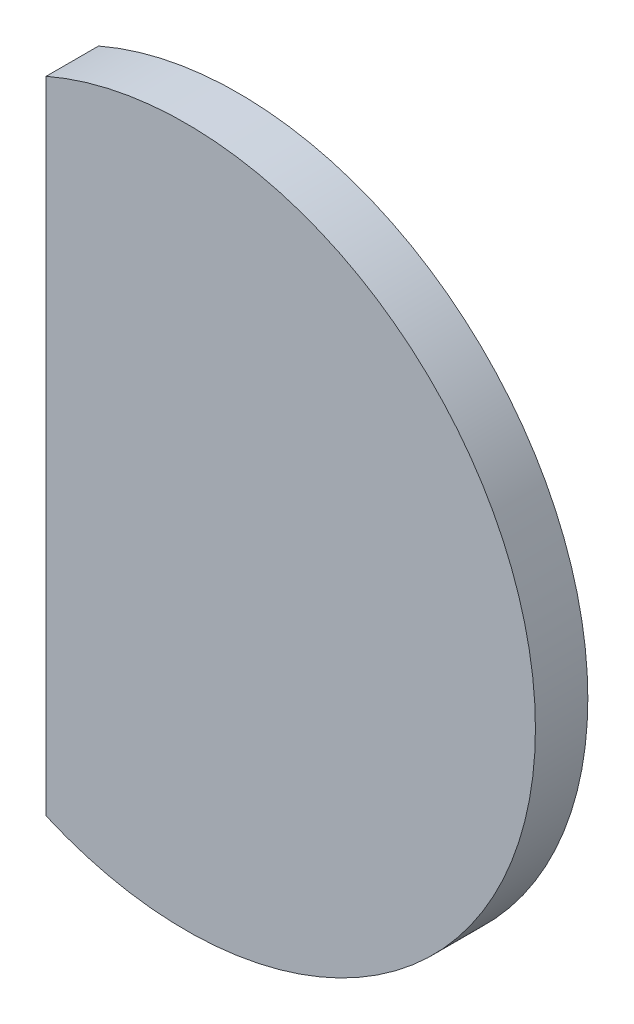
from build123d import *

# Parameters (mm, degrees)
DODANIE_WYCI_GNI_CIE1_DEPTH = 15


with BuildPart() as part:
    # Szkic1 → Dodanie-wyci_gni_cie1 (new body)
    with BuildSketch(Plane.XY):
        with BuildLine():
            Line((-40, 91.651513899), (-40, -91.651513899))
            ThreePointArc((-40, -91.651513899), (100, 0), (-40, 91.651513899))
        make_face()
    extrude(amount=DODANIE_WYCI_GNI_CIE1_DEPTH)


solid = part.part
